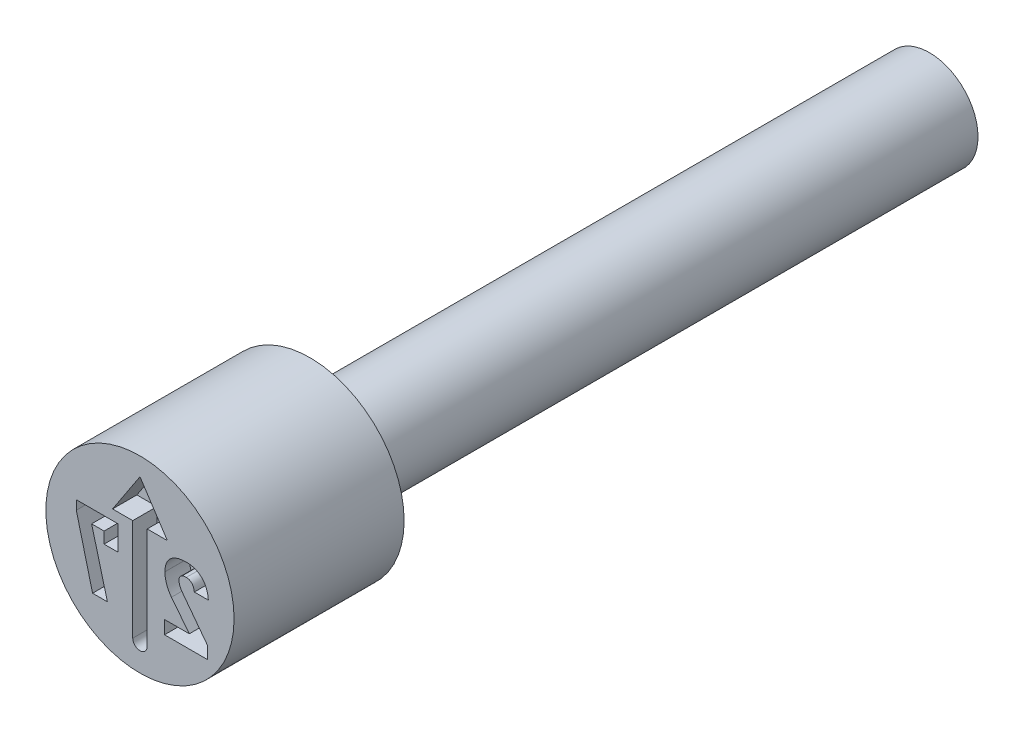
from build123d import *

# Parameters (mm, degrees)
CUT_EXTRUDE4_DEPTH = 0.4
CUT_EXTRUDE5_DEPTH = 0.4


with BuildPart() as part:
    # Sketch2 → Revolve1 (revolve)
    with BuildSketch(Plane(origin=(0, 0, 0), x_dir=(0, 0, -1), z_dir=(1, 0, 0)), mode=Mode.PRIVATE) as revolve1_sk:
        Polygon((0, 1.55), (0, 0), (13, 0), (13, 0.8), (2.8, 0.8), (2.8, 1.55), align=None)
    revolve(revolve1_sk.sketch.rotate(Axis((0, 0, -0.403888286), (0, 0, -1)), 90), axis=Axis((0, 0, -0.403888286), (0, 0, -1)))

    # Sketch3 → Cut-Extrude4 (cut)
    with BuildSketch(Plane.XY):
        with BuildLine():
            Line((0.119045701, 0.566469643), (0.119045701, -1.110101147))
            ThreePointArc((0.119045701, -1.110101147), (0, -1.229146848), (-0.119045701, -1.110101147))
            Line((-0.119045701, -1.110101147), (-0.119045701, 0.566469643))
            Line((-0.119045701, 0.566469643), (-0.451198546, 0.566469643))
            Line((-0.451198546, 0.566469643), (0, 1.251322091))
            Line((0, 1.251322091), (0.451198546, 0.566469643))
            Line((0.451198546, 0.566469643), (0.119045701, 0.566469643))
        make_face()
    extrude(amount=-CUT_EXTRUDE4_DEPTH, mode=Mode.SUBTRACT)

    # Sketch4 → Cut-Extrude5 (cut)
    with BuildSketch(Plane.XY):
        with BuildLine():
            Line((1.11112013, -0.8), (1.11112013, -0.595941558))
            Line((1.11112013, -0.595941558), (0.701055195, -0.052678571))
            add(Edge.make_bspline(
                [(0.701055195, -0.052678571), (0.692466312, -0.040576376), (0.675731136, -0.016995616), (0.660584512, 0.015387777), (0.651148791, 0.040776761), (0.646651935, 0.059188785), (0.643444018, 0.076755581), (0.643049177, 0.088298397), (0.642857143, 0.093912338)],
                knots=[0, 0, 0, 0, 1.664252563, 3.24274559, 3.998498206, 4.704056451, 5.369707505, 6, 6, 6, 6], degree=3))
            Line((0.642857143, 0.093912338), (0.642857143, 0.095616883))
            add(Edge.make_bspline(
                [(0.642857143, 0.095616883), (0.643189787, 0.103289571), (0.64382708, 0.117989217), (0.649831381, 0.138701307), (0.659672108, 0.156738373), (0.673766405, 0.171636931), (0.691312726, 0.183420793), (0.712307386, 0.191725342), (0.736475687, 0.196487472), (0.753630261, 0.19708696), (0.762662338, 0.197402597)],
                knots=[0, 0, 0, 0, 1.029992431, 1.973301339, 2.872554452, 3.768620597, 4.704316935, 5.693697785, 6.785705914, 8, 8, 8, 8], degree=3))
            add(Edge.make_bspline(
                [(0.762662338, 0.197402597), (0.771484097, 0.197058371), (0.788625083, 0.196389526), (0.81289107, 0.188976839), (0.834757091, 0.177349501), (0.853607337, 0.160758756), (0.869216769, 0.139928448), (0.881885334, 0.115399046), (0.890489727, 0.086727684), (0.893533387, 0.066203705), (0.89512987, 0.055438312)],
                knots=[0, 0, 0, 0, 0.980828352, 1.905783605, 2.800718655, 3.724477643, 4.680224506, 5.688112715, 6.78735127, 8, 8, 8, 8], degree=3))
            Line((0.89512987, 0.055438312), (1.125974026, 0.054707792))
            add(Edge.make_bspline(
                [(1.125974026, 0.054707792), (1.124834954, 0.069348), (1.122611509, 0.096499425), (1.115322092, 0.135775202), (1.105900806, 0.172770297), (1.093915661, 0.207477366), (1.078514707, 0.23949454), (1.061211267, 0.26949113), (1.040399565, 0.296539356), (1.01761824, 0.321544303), (0.992243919, 0.343568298), (0.965187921, 0.362996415), (0.936041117, 0.379163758), (0.905246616, 0.392575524), (0.872462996, 0.402754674), (0.838118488, 0.410379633), (0.801818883, 0.414776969), (0.777040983, 0.415311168), (0.764366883, 0.415584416)],
                knots=[0, 0, 0, 0, 1.173229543, 2.290119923, 3.354877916, 4.382703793, 5.372196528, 6.339367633, 7.289741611, 8.236749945, 9.180232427, 10.11040526, 11.033485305, 11.978374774, 12.930610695, 13.916256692, 14.93414813, 16, 16, 16, 16], degree=3))
            add(Edge.make_bspline(
                [(0.764366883, 0.415584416), (0.750719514, 0.415390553), (0.724177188, 0.415013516), (0.685536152, 0.41094352), (0.649179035, 0.404800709), (0.615164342, 0.395814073), (0.583628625, 0.384091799), (0.554477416, 0.369957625), (0.527649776, 0.353291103), (0.503351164, 0.334056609), (0.481488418, 0.312603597), (0.462670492, 0.288714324), (0.446380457, 0.262871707), (0.433646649, 0.234574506), (0.423163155, 0.204488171), (0.416375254, 0.172073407), (0.411801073, 0.13771186), (0.411297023, 0.114058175), (0.411038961, 0.101948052)],
                knots=[0, 0, 0, 0, 1.219700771, 2.37215663, 3.469774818, 4.513610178, 5.512457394, 6.473141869, 7.405450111, 8.330272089, 9.238546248, 10.1372905, 11.043445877, 11.962355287, 12.905558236, 13.886315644, 14.917844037, 16, 16, 16, 16], degree=3))
            add(Edge.make_bspline(
                [(0.411038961, 0.101948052), (0.411349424, 0.087320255), (0.411970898, 0.059988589), (0.4175807, 0.019082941), (0.426620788, -0.021613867), (0.439036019, -0.061905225), (0.454458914, -0.101093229), (0.472969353, -0.138641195), (0.493860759, -0.17456574), (0.510415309, -0.196737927), (0.518668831, -0.207792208)],
                knots=[0, 0, 0, 0, 0.984368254, 1.970475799, 2.971844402, 3.988480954, 5.008197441, 6.005725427, 7.005724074, 8, 8, 8, 8], degree=3))
            Line((0.518668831, -0.207792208), (0.812824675, -0.581818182))
            Line((0.812824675, -0.581818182), (0.404464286, -0.581818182))
            Line((0.404464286, -0.581818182), (0.404464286, -0.8))
            Line((0.404464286, -0.8), (1.11112013, -0.8))
        make_face()
        Polygon((-1.048246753, 0.4), (-1.048246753, 0.249512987), (-0.78038961, -0.8), (-0.536396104, -0.8), (-0.795974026, 0.181818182), (-0.590698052, 0.181818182), (-0.590698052, -0.005194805), (-0.365454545, -0.005194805), (-0.365454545, 0.4), align=None)
    extrude(amount=-CUT_EXTRUDE5_DEPTH, mode=Mode.SUBTRACT)


solid = part.part
